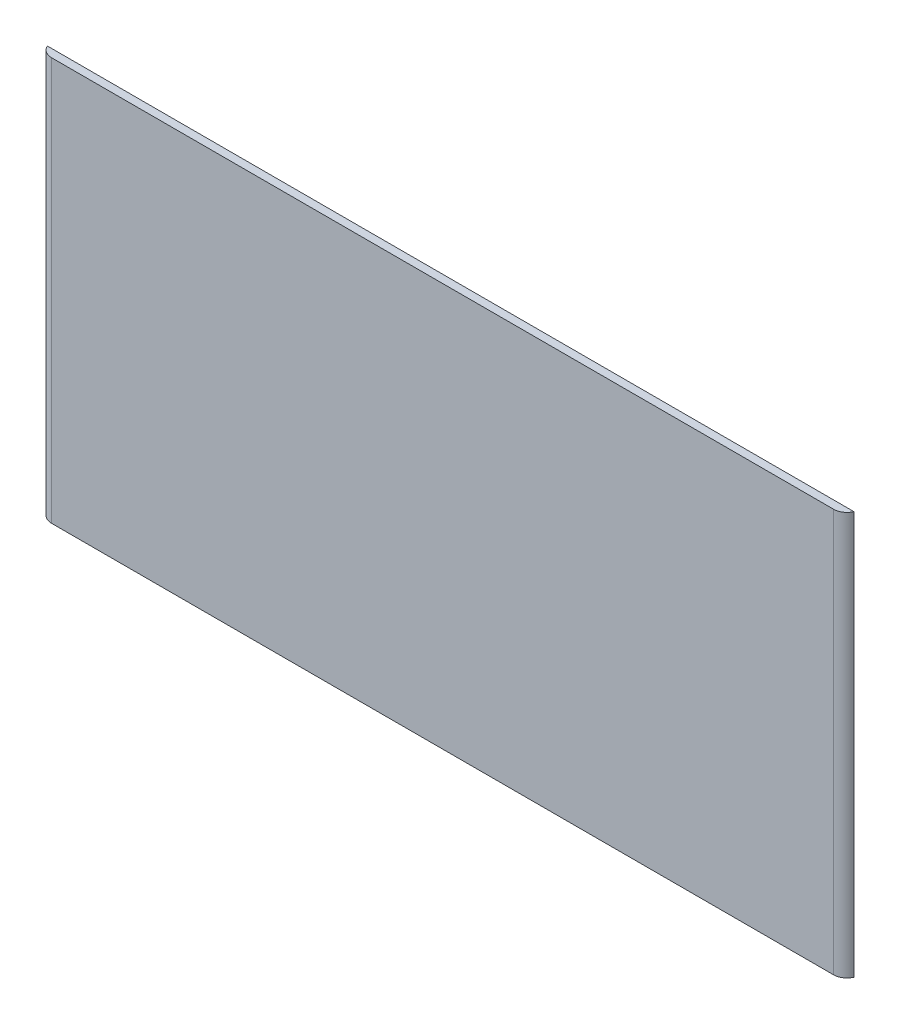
ISO-10303-21;
HEADER;
FILE_DESCRIPTION(('STEP AP214'),'2;1');
FILE_NAME('part.step','',(''),(''),'','','');
FILE_SCHEMA(('AUTOMOTIVE_DESIGN { 1 0 10303 214 1 1 1 1 }'));
ENDSEC;
DATA;
#1=APPLICATION_CONTEXT('core data for automotive mechanical design processes');
#2=APPLICATION_PROTOCOL_DEFINITION('international standard','automotive_design',2000,#1);
#3=PRODUCT_CONTEXT('',#1,'mechanical');
#4=PRODUCT('Part','Part','',(#3));
#5=PRODUCT_RELATED_PRODUCT_CATEGORY('part','',(#4));
#6=PRODUCT_DEFINITION_FORMATION('','',#4);
#7=PRODUCT_DEFINITION_CONTEXT('part definition',#1,'design');
#8=PRODUCT_DEFINITION('design','',#6,#7);
#9=PRODUCT_DEFINITION_SHAPE('','',#8);
#10=(LENGTH_UNIT() NAMED_UNIT(*) SI_UNIT(.MILLI.,.METRE.));
#11=(NAMED_UNIT(*) PLANE_ANGLE_UNIT() SI_UNIT($,.RADIAN.));
#12=(NAMED_UNIT(*) SI_UNIT($,.STERADIAN.) SOLID_ANGLE_UNIT());
#13=UNCERTAINTY_MEASURE_WITH_UNIT(LENGTH_MEASURE(1.E-05),#10,'distance_accuracy_value','');
#14=(GEOMETRIC_REPRESENTATION_CONTEXT(3) GLOBAL_UNCERTAINTY_ASSIGNED_CONTEXT((#13)) GLOBAL_UNIT_ASSIGNED_CONTEXT((#10,
#11,#12)) REPRESENTATION_CONTEXT('',''));
#15=CARTESIAN_POINT('',(0.,0.,0.));
#16=DIRECTION('',(0.,0.,1.));
#17=DIRECTION('',(1.,0.,0.));
#18=AXIS2_PLACEMENT_3D('',#15,#16,#17);
#19=CARTESIAN_POINT('',(0.,-300.,6.));
#20=DIRECTION('',(0.,1.,0.));
#21=DIRECTION('',(0.,0.,1.));
#22=AXIS2_PLACEMENT_3D('',#19,#20,#21);
#23=PLANE('',#22);
#24=DIRECTION('',(1.,0.,0.));
#25=VECTOR('',#24,1.);
#26=CARTESIAN_POINT('',(0.,-300.,6.));
#27=LINE('',#26,#25);
#28=CARTESIAN_POINT('',(9.16515138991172,-300.,6.));
#29=VERTEX_POINT('',#28);
#30=CARTESIAN_POINT('',(590.834848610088,-300.,6.));
#31=VERTEX_POINT('',#30);
#32=EDGE_CURVE('E89',#29,#31,#27,.T.);
#33=ORIENTED_EDGE('',*,*,#32,.F.);
#34=CARTESIAN_POINT('',(9.16515138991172,-300.,-4.));
#35=DIRECTION('',(0.,1.,0.));
#36=DIRECTION('',(0.,0.,1.));
#37=AXIS2_PLACEMENT_3D('',#34,#35,#36);
#38=CIRCLE('',#37,10.);
#39=CARTESIAN_POINT('',(0.,-300.,0.));
#40=VERTEX_POINT('',#39);
#41=EDGE_CURVE('E54',#29,#40,#38,.F.);
#42=ORIENTED_EDGE('',*,*,#41,.T.);
#43=DIRECTION('',(1.,0.,0.));
#44=VECTOR('',#43,1.);
#45=CARTESIAN_POINT('',(0.,-300.,0.));
#46=LINE('',#45,#44);
#47=CARTESIAN_POINT('',(600.,-300.,0.));
#48=VERTEX_POINT('',#47);
#49=EDGE_CURVE('E87',#40,#48,#46,.T.);
#50=ORIENTED_EDGE('',*,*,#49,.T.);
#51=CARTESIAN_POINT('',(590.834848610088,-300.,-4.));
#52=DIRECTION('',(0.,1.,0.));
#53=DIRECTION('',(0.,0.,1.));
#54=AXIS2_PLACEMENT_3D('',#51,#52,#53);
#55=CIRCLE('',#54,10.);
#56=EDGE_CURVE('E120',#48,#31,#55,.F.);
#57=ORIENTED_EDGE('',*,*,#56,.T.);
#58=EDGE_LOOP('',(#33,#42,#50,#57));
#59=FACE_BOUND('',#58,.T.);
#60=ADVANCED_FACE('F45',(#59),#23,.F.);
#61=CARTESIAN_POINT('',(0.,0.,6.));
#62=DIRECTION('',(0.,-1.,0.));
#63=DIRECTION('',(0.,0.,-1.));
#64=AXIS2_PLACEMENT_3D('',#61,#62,#63);
#65=PLANE('',#64);
#66=DIRECTION('',(-1.,0.,0.));
#67=VECTOR('',#66,1.);
#68=CARTESIAN_POINT('',(0.,0.,0.));
#69=LINE('',#68,#67);
#70=CARTESIAN_POINT('',(600.,0.,0.));
#71=VERTEX_POINT('',#70);
#72=CARTESIAN_POINT('',(0.,0.,0.));
#73=VERTEX_POINT('',#72);
#74=EDGE_CURVE('E110',#71,#73,#69,.T.);
#75=ORIENTED_EDGE('',*,*,#74,.T.);
#76=CARTESIAN_POINT('',(9.16515138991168,0.,-4.));
#77=DIRECTION('',(0.,-1.,0.));
#78=DIRECTION('',(0.,0.,-1.));
#79=AXIS2_PLACEMENT_3D('',#76,#77,#78);
#80=CIRCLE('',#79,10.);
#81=CARTESIAN_POINT('',(9.16515138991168,0.,6.));
#82=VERTEX_POINT('',#81);
#83=EDGE_CURVE('E11',#73,#82,#80,.F.);
#84=ORIENTED_EDGE('',*,*,#83,.T.);
#85=DIRECTION('',(-1.,0.,0.));
#86=VECTOR('',#85,1.);
#87=CARTESIAN_POINT('',(0.,0.,6.));
#88=LINE('',#87,#86);
#89=CARTESIAN_POINT('',(590.834848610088,0.,6.));
#90=VERTEX_POINT('',#89);
#91=EDGE_CURVE('E105',#90,#82,#88,.T.);
#92=ORIENTED_EDGE('',*,*,#91,.F.);
#93=CARTESIAN_POINT('',(590.834848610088,0.,-4.));
#94=DIRECTION('',(0.,-1.,0.));
#95=DIRECTION('',(0.,0.,-1.));
#96=AXIS2_PLACEMENT_3D('',#93,#94,#95);
#97=CIRCLE('',#96,10.);
#98=EDGE_CURVE('E117',#90,#71,#97,.F.);
#99=ORIENTED_EDGE('',*,*,#98,.T.);
#100=EDGE_LOOP('',(#75,#84,#92,#99));
#101=FACE_BOUND('',#100,.T.);
#102=ADVANCED_FACE('F129',(#101),#65,.F.);
#103=CARTESIAN_POINT('',(0.,0.,6.));
#104=DIRECTION('',(0.,0.,1.));
#105=DIRECTION('',(1.,0.,0.));
#106=AXIS2_PLACEMENT_3D('',#103,#104,#105);
#107=PLANE('',#106);
#108=ORIENTED_EDGE('',*,*,#91,.T.);
#109=DIRECTION('',(0.,1.,0.));
#110=VECTOR('',#109,1.);
#111=CARTESIAN_POINT('',(9.16515138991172,-300.,6.));
#112=LINE('',#111,#110);
#113=EDGE_CURVE('E91',#82,#29,#112,.F.);
#114=ORIENTED_EDGE('',*,*,#113,.T.);
#115=ORIENTED_EDGE('',*,*,#32,.T.);
#116=DIRECTION('',(0.,-1.,0.));
#117=VECTOR('',#116,1.);
#118=CARTESIAN_POINT('',(590.834848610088,0.,6.));
#119=LINE('',#118,#117);
#120=EDGE_CURVE('E113',#31,#90,#119,.F.);
#121=ORIENTED_EDGE('',*,*,#120,.T.);
#122=EDGE_LOOP('',(#108,#114,#115,#121));
#123=FACE_BOUND('',#122,.T.);
#124=ADVANCED_FACE('F125',(#123),#107,.T.);
#125=CARTESIAN_POINT('',(0.,0.,0.));
#126=DIRECTION('',(0.,0.,1.));
#127=DIRECTION('',(1.,0.,0.));
#128=AXIS2_PLACEMENT_3D('',#125,#126,#127);
#129=PLANE('',#128);
#130=DIRECTION('',(0.,-1.,0.));
#131=VECTOR('',#130,1.);
#132=CARTESIAN_POINT('',(0.,0.,0.));
#133=LINE('',#132,#131);
#134=EDGE_CURVE('E96',#73,#40,#133,.T.);
#135=ORIENTED_EDGE('',*,*,#134,.F.);
#136=ORIENTED_EDGE('',*,*,#74,.F.);
#137=DIRECTION('',(0.,1.,0.));
#138=VECTOR('',#137,1.);
#139=CARTESIAN_POINT('',(600.,0.,0.));
#140=LINE('',#139,#138);
#141=EDGE_CURVE('E98',#48,#71,#140,.T.);
#142=ORIENTED_EDGE('',*,*,#141,.F.);
#143=ORIENTED_EDGE('',*,*,#49,.F.);
#144=EDGE_LOOP('',(#135,#136,#142,#143));
#145=FACE_BOUND('',#144,.T.);
#146=ADVANCED_FACE('F94',(#145),#129,.F.);
#147=CARTESIAN_POINT('',(590.834848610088,0.,-4.));
#148=DIRECTION('',(0.,1.,0.));
#149=DIRECTION('',(0.,0.,1.));
#150=AXIS2_PLACEMENT_3D('',#147,#148,#149);
#151=CYLINDRICAL_SURFACE('',#150,10.);
#152=ORIENTED_EDGE('',*,*,#56,.F.);
#153=ORIENTED_EDGE('',*,*,#141,.T.);
#154=ORIENTED_EDGE('',*,*,#98,.F.);
#155=ORIENTED_EDGE('',*,*,#120,.F.);
#156=EDGE_LOOP('',(#152,#153,#154,#155));
#157=FACE_BOUND('',#156,.T.);
#158=ADVANCED_FACE('F131',(#157),#151,.T.);
#159=CARTESIAN_POINT('',(9.16515138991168,0.,-4.));
#160=DIRECTION('',(0.,-1.,0.));
#161=DIRECTION('',(1.,0.,0.));
#162=AXIS2_PLACEMENT_3D('',#159,#160,#161);
#163=CYLINDRICAL_SURFACE('',#162,10.);
#164=ORIENTED_EDGE('',*,*,#83,.F.);
#165=ORIENTED_EDGE('',*,*,#134,.T.);
#166=ORIENTED_EDGE('',*,*,#41,.F.);
#167=ORIENTED_EDGE('',*,*,#113,.F.);
#168=EDGE_LOOP('',(#164,#165,#166,#167));
#169=FACE_BOUND('',#168,.T.);
#170=ADVANCED_FACE('F47',(#169),#163,.T.);
#171=CLOSED_SHELL('',(#60,#102,#124,#146,#158,#170));
#172=MANIFOLD_SOLID_BREP('B2',#171);
#173=ADVANCED_BREP_SHAPE_REPRESENTATION('',(#18,#172),#14);
#174=SHAPE_DEFINITION_REPRESENTATION(#9,#173);
ENDSEC;
END-ISO-10303-21;
